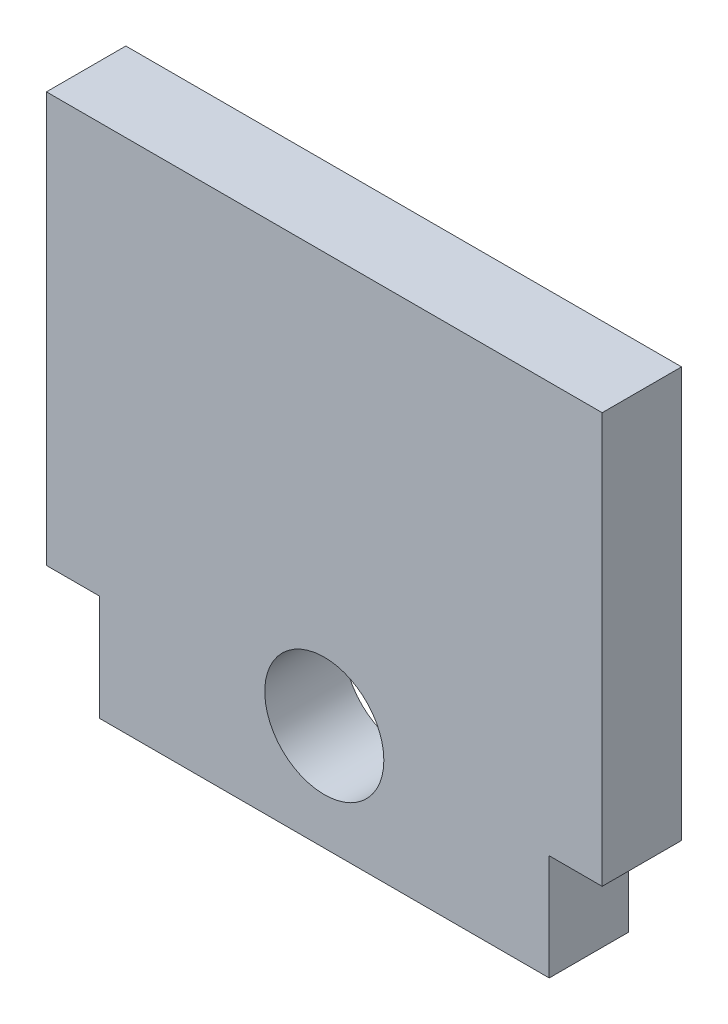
from build123d import *

# Parameters (mm, degrees)
SKETCH1_R           = 4.5
BOSS_EXTRUDE1_DEPTH = 6


with BuildPart() as part:
    # Sketch1 → Boss-Extrude1 (new body)
    with BuildSketch(Plane.XY):
        Polygon((0, 0), (0, 8), (-4, 8), (-4, 39), (38, 39), (38, 8), (34, 8), (34, 0), align=None)
        with Locations((17, 8)):
            Circle(SKETCH1_R, mode=Mode.SUBTRACT)
    extrude(amount=BOSS_EXTRUDE1_DEPTH)


solid = part.part
